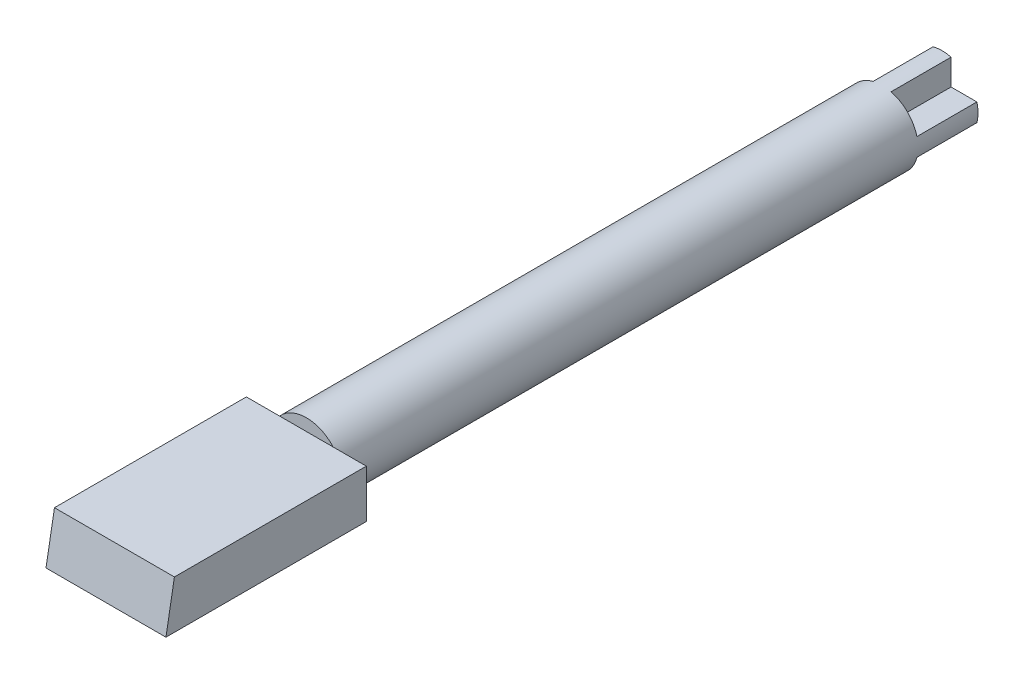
from build123d import *
from build123d.topology import SkipClean

# Parameters (mm, degrees)
SKETCH_1_R      = 3
EXTRUDE_1_DEPTH = 48
EXTRUDE_2_DEPTH = 5
EXTRUDE_START   = 5
SKETCH_3_W      = 2.15473751
SKETCH_3_H      = 1.5
SKETCH_3_W_2    = 1.5
SKETCH_3_H_2    = 2.15473751
EXTRUDE_4_DEPTH = 5


with BuildPart() as part:
    # Sketch 1 → Extrude 1 (new body)
    with BuildSketch(Plane.XY):
        Circle(SKETCH_1_R)
    extrude(amount=EXTRUDE_1_DEPTH)

    # Sketch 2 → Extrude 2 (add, symmetric)
    with BuildSketch(Plane(origin=(0, 0, 0), x_dir=(0, 0, -1), z_dir=(1, 0, 0))):
        Polygon((-48, 2), (-64, 2), (-64.705307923, -2), (-48, -2), align=None)
    extrude(amount=EXTRUDE_2_DEPTH, both=True)

    # Sketch 3 → Extrude 4 (add)
    with SkipClean():  # the faces are left unmerged after this step: merging them gives an invalid solid
        with BuildSketch(Plane(origin=(0, 0, 0), x_dir=(-1, 0, 0), z_dir=(0, 0, -1)).offset(EXTRUDE_START)):
            with Locations((1.827368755, 0)):
                Rectangle(SKETCH_3_W, SKETCH_3_H)
            with BuildLine():
                ThreePointArc((3, 0), (2.976089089, 0.378012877), (2.90473751, 0.75))
                Line((2.90473751, 0.75), (2.90473751, -0.75))
                ThreePointArc((2.90473751, -0.75), (2.976089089, -0.378012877), (3, 0))
            make_face()
            Rectangle(SKETCH_3_W_2, SKETCH_3_H)
            with Locations((0, 1.827368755)):
                Rectangle(SKETCH_3_W_2, SKETCH_3_H_2)
            with Locations((-1.827368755, 0)):
                Rectangle(SKETCH_3_W, SKETCH_3_H)
            with Locations((0, -1.827368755)):
                Rectangle(SKETCH_3_W_2, SKETCH_3_H_2)
            with BuildLine():
                Line((-2.90473751, -0.75), (-2.90473751, 0.75))
                ThreePointArc((-2.90473751, 0.75), (-3, 0), (-2.90473751, -0.75))
            make_face()
            with BuildLine():
                Line((-0.75, 2.90473751), (0.75, 2.90473751))
                ThreePointArc((0.75, 2.90473751), (0, 3), (-0.75, 2.90473751))
            make_face()
            with BuildLine():
                ThreePointArc((-0.75, -2.90473751), (0, -3), (0.75, -2.90473751))
                Line((0.75, -2.90473751), (-0.75, -2.90473751))
            make_face()
        extrude(amount=-EXTRUDE_4_DEPTH)


solid = part.part
